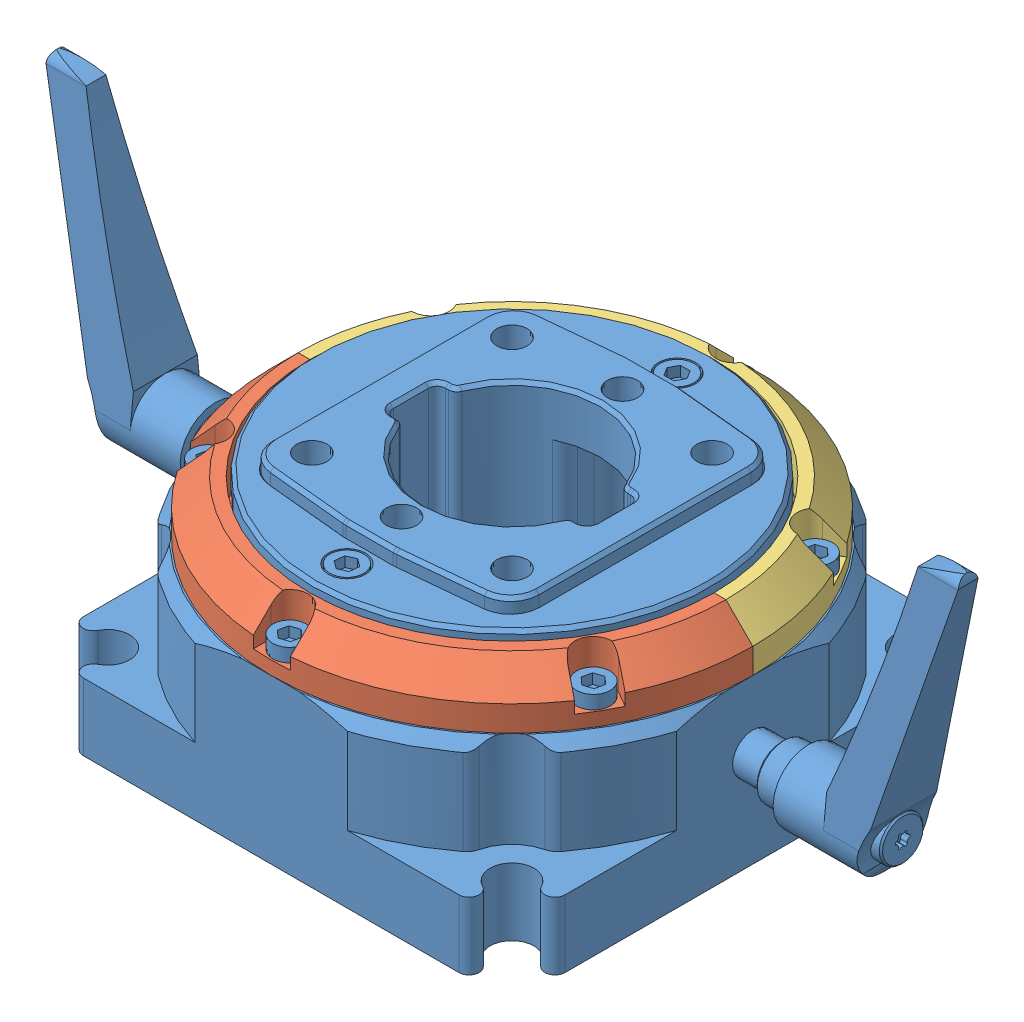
SolidWorks assembly C1A-XC0-XT.sldasm, configuration ﾃﾞﾌｫﾙﾄ (file format 4700). Lengths in mm.
Overall size (270.81 106.51 143).
3 component instances, 3 part files, 0 mates.
Components (placement in the parent):
- TM MAX Housing_KETSUGO-1: TM MAX Housing_KETSUGO.sldprt [ﾃﾞﾌｫﾙﾄ] at origin size (270.81 106.51 143)
- TM MAX Angle adjust plate(A)-1: TM MAX Angle adjust plate(A).sldprt [ﾃﾞﾌｫﾙﾄ] at (72.5 59 0) x (0 0 -1) z (1 0 0) size (71.5 15.5 143)
- TM MAX Angle adjust plate(B)-1: TM MAX Angle adjust plate(B).sldprt [ﾃﾞﾌｫﾙﾄ] at (72.5 59 0) x (0 0 -1) z (1 0 0) size (71.5 15.5 143)
